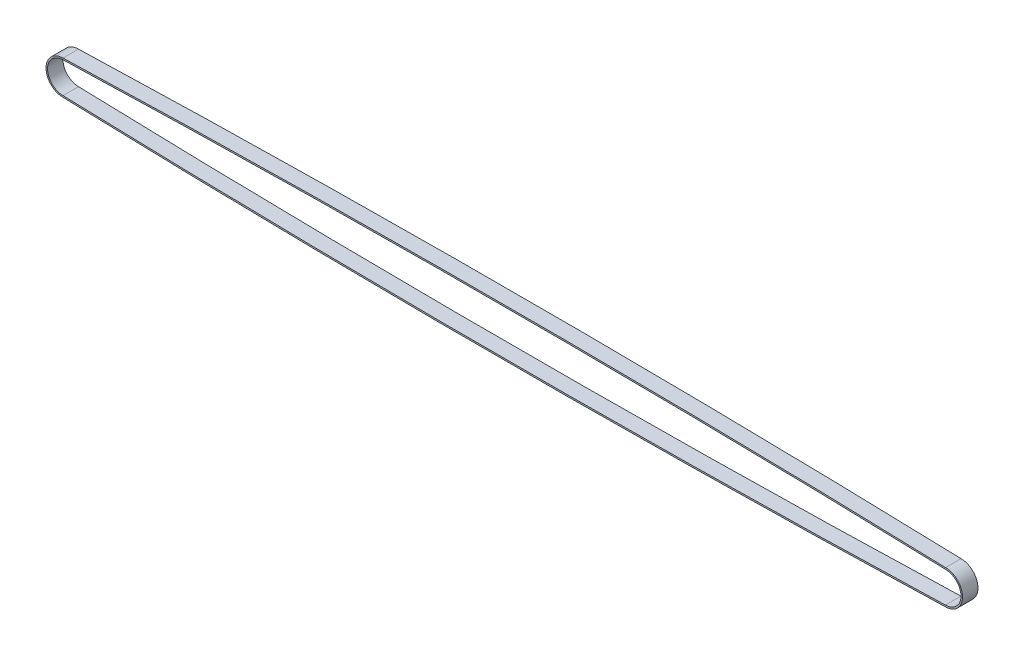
ISO-10303-21;
HEADER;
FILE_DESCRIPTION(('STEP AP214'),'2;1');
FILE_NAME('part.step','',(''),(''),'','','');
FILE_SCHEMA(('AUTOMOTIVE_DESIGN { 1 0 10303 214 1 1 1 1 }'));
ENDSEC;
DATA;
#1=APPLICATION_CONTEXT('core data for automotive mechanical design processes');
#2=APPLICATION_PROTOCOL_DEFINITION('international standard','automotive_design',2000,#1);
#3=PRODUCT_CONTEXT('',#1,'mechanical');
#4=PRODUCT('Part','Part','',(#3));
#5=PRODUCT_RELATED_PRODUCT_CATEGORY('part','',(#4));
#6=PRODUCT_DEFINITION_FORMATION('','',#4);
#7=PRODUCT_DEFINITION_CONTEXT('part definition',#1,'design');
#8=PRODUCT_DEFINITION('design','',#6,#7);
#9=PRODUCT_DEFINITION_SHAPE('','',#8);
#10=(LENGTH_UNIT() NAMED_UNIT(*) SI_UNIT(.MILLI.,.METRE.));
#11=(NAMED_UNIT(*) PLANE_ANGLE_UNIT() SI_UNIT($,.RADIAN.));
#12=(NAMED_UNIT(*) SI_UNIT($,.STERADIAN.) SOLID_ANGLE_UNIT());
#13=UNCERTAINTY_MEASURE_WITH_UNIT(LENGTH_MEASURE(1.E-05),#10,'distance_accuracy_value','');
#14=(GEOMETRIC_REPRESENTATION_CONTEXT(3) GLOBAL_UNCERTAINTY_ASSIGNED_CONTEXT((#13)) GLOBAL_UNIT_ASSIGNED_CONTEXT((#10,
#11,#12)) REPRESENTATION_CONTEXT('',''));
#15=CARTESIAN_POINT('',(0.,0.,0.));
#16=DIRECTION('',(0.,0.,1.));
#17=DIRECTION('',(1.,0.,0.));
#18=AXIS2_PLACEMENT_3D('',#15,#16,#17);
#19=CARTESIAN_POINT('',(361.95,-11436.9676875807,25.4));
#20=DIRECTION('',(0.,0.,-1.));
#21=DIRECTION('',(-1.,0.,0.));
#22=AXIS2_PLACEMENT_3D('',#19,#20,#21);
#23=PLANE('',#22);
#24=CARTESIAN_POINT('',(0.,-25.4000000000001,25.4));
#25=DIRECTION('',(0.,0.,1.));
#26=DIRECTION('',(-1.,0.,0.));
#27=AXIS2_PLACEMENT_3D('',#24,#25,#26);
#28=CIRCLE('',#27,27.9400000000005);
#29=CARTESIAN_POINT('',(-0.0411837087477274,2.53996964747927,25.4));
#30=VERTEX_POINT('',#29);
#31=CARTESIAN_POINT('',(-0.0411837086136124,-53.3399696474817,25.4));
#32=VERTEX_POINT('',#31);
#33=EDGE_CURVE('E134',#30,#32,#28,.T.);
#34=ORIENTED_EDGE('',*,*,#33,.T.);
#35=CARTESIAN_POINT('',(723.9,22797.7353751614,25.4));
#36=DIRECTION('',(0.,0.,1.));
#37=DIRECTION('',(1.,0.,0.));
#38=AXIS2_PLACEMENT_3D('',#35,#36,#37);
#39=CIRCLE('',#38,22862.54);
#40=CARTESIAN_POINT('',(1447.84118370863,-53.33996964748,25.4));
#41=VERTEX_POINT('',#40);
#42=EDGE_CURVE('E137',#32,#41,#39,.T.);
#43=ORIENTED_EDGE('',*,*,#42,.T.);
#44=CARTESIAN_POINT('',(1447.8,-25.4,25.4));
#45=DIRECTION('',(0.,0.,1.));
#46=DIRECTION('',(1.,0.,0.));
#47=AXIS2_PLACEMENT_3D('',#44,#45,#46);
#48=CIRCLE('',#47,27.9399999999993);
#49=CARTESIAN_POINT('',(1447.84118370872,2.53996964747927,25.4));
#50=VERTEX_POINT('',#49);
#51=EDGE_CURVE('E140',#41,#50,#48,.T.);
#52=ORIENTED_EDGE('',*,*,#51,.T.);
#53=CARTESIAN_POINT('',(723.9,-22848.5353751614,25.4));
#54=DIRECTION('',(0.,0.,1.));
#55=DIRECTION('',(-1.,0.,0.));
#56=AXIS2_PLACEMENT_3D('',#53,#54,#55);
#57=CIRCLE('',#56,22862.54);
#58=EDGE_CURVE('E142',#50,#30,#57,.T.);
#59=ORIENTED_EDGE('',*,*,#58,.T.);
#60=EDGE_LOOP('',(#34,#43,#52,#59));
#61=FACE_BOUND('',#60,.T.);
#62=CARTESIAN_POINT('',(723.9,-22848.5353751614,25.4));
#63=DIRECTION('',(0.,0.,1.));
#64=DIRECTION('',(-1.,0.,0.));
#65=AXIS2_PLACEMENT_3D('',#62,#63,#64);
#66=CIRCLE('',#65,22860.);
#67=CARTESIAN_POINT('',(1447.8,0.,25.4));
#68=VERTEX_POINT('',#67);
#69=CARTESIAN_POINT('',(0.,0.,25.4));
#70=VERTEX_POINT('',#69);
#71=EDGE_CURVE('E98',#68,#70,#66,.T.);
#72=ORIENTED_EDGE('',*,*,#71,.F.);
#73=CARTESIAN_POINT('',(1447.8,-25.4,25.4));
#74=DIRECTION('',(0.,0.,1.));
#75=DIRECTION('',(1.,0.,0.));
#76=AXIS2_PLACEMENT_3D('',#73,#74,#75);
#77=CIRCLE('',#76,25.4);
#78=CARTESIAN_POINT('',(1447.8,-50.8,25.4));
#79=VERTEX_POINT('',#78);
#80=EDGE_CURVE('E120',#79,#68,#77,.T.);
#81=ORIENTED_EDGE('',*,*,#80,.F.);
#82=CARTESIAN_POINT('',(723.9,22797.7353751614,25.4));
#83=DIRECTION('',(0.,0.,1.));
#84=DIRECTION('',(1.,0.,0.));
#85=AXIS2_PLACEMENT_3D('',#82,#83,#84);
#86=CIRCLE('',#85,22860.);
#87=CARTESIAN_POINT('',(0.,-50.8000000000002,25.4));
#88=VERTEX_POINT('',#87);
#89=EDGE_CURVE('E118',#88,#79,#86,.T.);
#90=ORIENTED_EDGE('',*,*,#89,.F.);
#91=CARTESIAN_POINT('',(0.,-25.4000000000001,25.4));
#92=DIRECTION('',(0.,0.,1.));
#93=DIRECTION('',(-1.,0.,0.));
#94=AXIS2_PLACEMENT_3D('',#91,#92,#93);
#95=CIRCLE('',#94,25.4000000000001);
#96=EDGE_CURVE('E106',#70,#88,#95,.T.);
#97=ORIENTED_EDGE('',*,*,#96,.F.);
#98=EDGE_LOOP('',(#72,#81,#90,#97));
#99=FACE_BOUND('',#98,.T.);
#100=ADVANCED_FACE('F33',(#61,#99),#23,.F.);
#101=CARTESIAN_POINT('',(361.95,-11436.9676875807,0.));
#102=DIRECTION('',(0.,0.,-1.));
#103=DIRECTION('',(-1.,0.,0.));
#104=AXIS2_PLACEMENT_3D('',#101,#102,#103);
#105=PLANE('',#104);
#106=CARTESIAN_POINT('',(0.,-25.4000000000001,0.));
#107=DIRECTION('',(0.,0.,1.));
#108=DIRECTION('',(-1.,0.,0.));
#109=AXIS2_PLACEMENT_3D('',#106,#107,#108);
#110=CIRCLE('',#109,27.9400000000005);
#111=CARTESIAN_POINT('',(-0.0411837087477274,2.53996964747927,0.));
#112=VERTEX_POINT('',#111);
#113=CARTESIAN_POINT('',(-0.0411837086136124,-53.3399696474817,0.));
#114=VERTEX_POINT('',#113);
#115=EDGE_CURVE('E114',#112,#114,#110,.T.);
#116=ORIENTED_EDGE('',*,*,#115,.F.);
#117=CARTESIAN_POINT('',(723.9,-22848.5353751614,0.));
#118=DIRECTION('',(0.,0.,1.));
#119=DIRECTION('',(-1.,0.,0.));
#120=AXIS2_PLACEMENT_3D('',#117,#118,#119);
#121=CIRCLE('',#120,22862.54);
#122=CARTESIAN_POINT('',(1447.84118370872,2.53996964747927,0.));
#123=VERTEX_POINT('',#122);
#124=EDGE_CURVE('E138',#123,#112,#121,.T.);
#125=ORIENTED_EDGE('',*,*,#124,.F.);
#126=CARTESIAN_POINT('',(1447.8,-25.4,0.));
#127=DIRECTION('',(0.,0.,1.));
#128=DIRECTION('',(1.,0.,0.));
#129=AXIS2_PLACEMENT_3D('',#126,#127,#128);
#130=CIRCLE('',#129,27.9399999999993);
#131=CARTESIAN_POINT('',(1447.84118370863,-53.33996964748,0.));
#132=VERTEX_POINT('',#131);
#133=EDGE_CURVE('E149',#132,#123,#130,.T.);
#134=ORIENTED_EDGE('',*,*,#133,.F.);
#135=CARTESIAN_POINT('',(723.9,22797.7353751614,0.));
#136=DIRECTION('',(0.,0.,1.));
#137=DIRECTION('',(1.,0.,0.));
#138=AXIS2_PLACEMENT_3D('',#135,#136,#137);
#139=CIRCLE('',#138,22862.54);
#140=EDGE_CURVE('E147',#114,#132,#139,.T.);
#141=ORIENTED_EDGE('',*,*,#140,.F.);
#142=EDGE_LOOP('',(#116,#125,#134,#141));
#143=FACE_BOUND('',#142,.T.);
#144=CARTESIAN_POINT('',(1447.8,-25.4,0.));
#145=DIRECTION('',(0.,0.,1.));
#146=DIRECTION('',(1.,0.,0.));
#147=AXIS2_PLACEMENT_3D('',#144,#145,#146);
#148=CIRCLE('',#147,25.4);
#149=CARTESIAN_POINT('',(1447.8,-50.7999999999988,0.));
#150=VERTEX_POINT('',#149);
#151=CARTESIAN_POINT('',(1447.8,0.,0.));
#152=VERTEX_POINT('',#151);
#153=EDGE_CURVE('E107',#150,#152,#148,.T.);
#154=ORIENTED_EDGE('',*,*,#153,.T.);
#155=CARTESIAN_POINT('',(723.9,-22848.5353751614,0.));
#156=DIRECTION('',(0.,0.,1.));
#157=DIRECTION('',(-1.,0.,0.));
#158=AXIS2_PLACEMENT_3D('',#155,#156,#157);
#159=CIRCLE('',#158,22860.);
#160=CARTESIAN_POINT('',(0.,0.,0.));
#161=VERTEX_POINT('',#160);
#162=EDGE_CURVE('E56',#152,#161,#159,.T.);
#163=ORIENTED_EDGE('',*,*,#162,.T.);
#164=CARTESIAN_POINT('',(0.,-25.4000000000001,0.));
#165=DIRECTION('',(0.,0.,1.));
#166=DIRECTION('',(-1.,0.,0.));
#167=AXIS2_PLACEMENT_3D('',#164,#165,#166);
#168=CIRCLE('',#167,25.4000000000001);
#169=CARTESIAN_POINT('',(0.,-50.8000000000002,0.));
#170=VERTEX_POINT('',#169);
#171=EDGE_CURVE('E113',#161,#170,#168,.T.);
#172=ORIENTED_EDGE('',*,*,#171,.T.);
#173=CARTESIAN_POINT('',(723.9,22797.7353751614,0.));
#174=DIRECTION('',(0.,0.,1.));
#175=DIRECTION('',(1.,0.,0.));
#176=AXIS2_PLACEMENT_3D('',#173,#174,#175);
#177=CIRCLE('',#176,22860.);
#178=EDGE_CURVE('E126',#170,#150,#177,.T.);
#179=ORIENTED_EDGE('',*,*,#178,.T.);
#180=EDGE_LOOP('',(#154,#163,#172,#179));
#181=FACE_BOUND('',#180,.T.);
#182=ADVANCED_FACE('F167',(#143,#181),#105,.T.);
#183=CARTESIAN_POINT('',(0.,-25.4000000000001,25.4));
#184=DIRECTION('',(0.,0.,-1.));
#185=DIRECTION('',(-1.,0.,0.));
#186=AXIS2_PLACEMENT_3D('',#183,#184,#185);
#187=CYLINDRICAL_SURFACE('',#186,27.9400000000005);
#188=ORIENTED_EDGE('',*,*,#115,.T.);
#189=DIRECTION('',(0.,0.,-1.));
#190=VECTOR('',#189,1.);
#191=CARTESIAN_POINT('',(-0.0411837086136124,-53.3399696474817,25.4));
#192=LINE('',#191,#190);
#193=EDGE_CURVE('E11',#32,#114,#192,.T.);
#194=ORIENTED_EDGE('',*,*,#193,.F.);
#195=ORIENTED_EDGE('',*,*,#33,.F.);
#196=DIRECTION('',(0.,0.,-1.));
#197=VECTOR('',#196,1.);
#198=CARTESIAN_POINT('',(-0.0411837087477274,2.53996964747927,25.4));
#199=LINE('',#198,#197);
#200=EDGE_CURVE('E144',#30,#112,#199,.T.);
#201=ORIENTED_EDGE('',*,*,#200,.T.);
#202=EDGE_LOOP('',(#188,#194,#195,#201));
#203=FACE_BOUND('',#202,.T.);
#204=ADVANCED_FACE('F35',(#203),#187,.T.);
#205=CARTESIAN_POINT('',(723.9,22797.7353751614,25.4));
#206=DIRECTION('',(0.,0.,-1.));
#207=DIRECTION('',(-1.,0.,0.));
#208=AXIS2_PLACEMENT_3D('',#205,#206,#207);
#209=CYLINDRICAL_SURFACE('',#208,22862.54);
#210=ORIENTED_EDGE('',*,*,#140,.T.);
#211=DIRECTION('',(0.,0.,-1.));
#212=VECTOR('',#211,1.);
#213=CARTESIAN_POINT('',(1447.84118370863,-53.33996964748,25.4));
#214=LINE('',#213,#212);
#215=EDGE_CURVE('E41',#41,#132,#214,.T.);
#216=ORIENTED_EDGE('',*,*,#215,.F.);
#217=ORIENTED_EDGE('',*,*,#42,.F.);
#218=ORIENTED_EDGE('',*,*,#193,.T.);
#219=EDGE_LOOP('',(#210,#216,#217,#218));
#220=FACE_BOUND('',#219,.T.);
#221=ADVANCED_FACE('F177',(#220),#209,.T.);
#222=CARTESIAN_POINT('',(1447.8,-25.4,25.4));
#223=DIRECTION('',(0.,0.,-1.));
#224=DIRECTION('',(-1.,0.,0.));
#225=AXIS2_PLACEMENT_3D('',#222,#223,#224);
#226=CYLINDRICAL_SURFACE('',#225,27.9399999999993);
#227=ORIENTED_EDGE('',*,*,#133,.T.);
#228=DIRECTION('',(0.,0.,-1.));
#229=VECTOR('',#228,1.);
#230=CARTESIAN_POINT('',(1447.84118370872,2.53996964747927,25.4));
#231=LINE('',#230,#229);
#232=EDGE_CURVE('E154',#50,#123,#231,.T.);
#233=ORIENTED_EDGE('',*,*,#232,.F.);
#234=ORIENTED_EDGE('',*,*,#51,.F.);
#235=ORIENTED_EDGE('',*,*,#215,.T.);
#236=EDGE_LOOP('',(#227,#233,#234,#235));
#237=FACE_BOUND('',#236,.T.);
#238=ADVANCED_FACE('F161',(#237),#226,.T.);
#239=CARTESIAN_POINT('',(723.9,-22848.5353751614,25.4));
#240=DIRECTION('',(0.,0.,-1.));
#241=DIRECTION('',(-1.,0.,0.));
#242=AXIS2_PLACEMENT_3D('',#239,#240,#241);
#243=CYLINDRICAL_SURFACE('',#242,22862.54);
#244=ORIENTED_EDGE('',*,*,#124,.T.);
#245=ORIENTED_EDGE('',*,*,#200,.F.);
#246=ORIENTED_EDGE('',*,*,#58,.F.);
#247=ORIENTED_EDGE('',*,*,#232,.T.);
#248=EDGE_LOOP('',(#244,#245,#246,#247));
#249=FACE_BOUND('',#248,.T.);
#250=ADVANCED_FACE('F171',(#249),#243,.T.);
#251=CARTESIAN_POINT('',(723.9,-22848.5353751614,25.4));
#252=DIRECTION('',(0.,0.,-1.));
#253=DIRECTION('',(-1.,0.,0.));
#254=AXIS2_PLACEMENT_3D('',#251,#252,#253);
#255=CYLINDRICAL_SURFACE('',#254,22860.);
#256=ORIENTED_EDGE('',*,*,#162,.F.);
#257=DIRECTION('',(0.,0.,-1.));
#258=VECTOR('',#257,1.);
#259=CARTESIAN_POINT('',(1447.8,0.,25.4));
#260=LINE('',#259,#258);
#261=EDGE_CURVE('E102',#68,#152,#260,.T.);
#262=ORIENTED_EDGE('',*,*,#261,.F.);
#263=ORIENTED_EDGE('',*,*,#71,.T.);
#264=DIRECTION('',(0.,0.,-1.));
#265=VECTOR('',#264,1.);
#266=CARTESIAN_POINT('',(0.,0.,25.4));
#267=LINE('',#266,#265);
#268=EDGE_CURVE('E101',#70,#161,#267,.T.);
#269=ORIENTED_EDGE('',*,*,#268,.T.);
#270=EDGE_LOOP('',(#256,#262,#263,#269));
#271=FACE_BOUND('',#270,.T.);
#272=ADVANCED_FACE('F100',(#271),#255,.F.);
#273=CARTESIAN_POINT('',(0.,-25.4000000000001,25.4));
#274=DIRECTION('',(0.,0.,-1.));
#275=DIRECTION('',(-1.,0.,0.));
#276=AXIS2_PLACEMENT_3D('',#273,#274,#275);
#277=CYLINDRICAL_SURFACE('',#276,25.4000000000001);
#278=ORIENTED_EDGE('',*,*,#171,.F.);
#279=ORIENTED_EDGE('',*,*,#268,.F.);
#280=ORIENTED_EDGE('',*,*,#96,.T.);
#281=DIRECTION('',(0.,0.,-1.));
#282=VECTOR('',#281,1.);
#283=CARTESIAN_POINT('',(0.,-50.8000000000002,25.4));
#284=LINE('',#283,#282);
#285=EDGE_CURVE('E115',#88,#170,#284,.T.);
#286=ORIENTED_EDGE('',*,*,#285,.T.);
#287=EDGE_LOOP('',(#278,#279,#280,#286));
#288=FACE_BOUND('',#287,.T.);
#289=ADVANCED_FACE('F110',(#288),#277,.F.);
#290=CARTESIAN_POINT('',(723.9,22797.7353751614,25.4));
#291=DIRECTION('',(0.,0.,-1.));
#292=DIRECTION('',(-1.,0.,0.));
#293=AXIS2_PLACEMENT_3D('',#290,#291,#292);
#294=CYLINDRICAL_SURFACE('',#293,22860.);
#295=ORIENTED_EDGE('',*,*,#178,.F.);
#296=ORIENTED_EDGE('',*,*,#285,.F.);
#297=ORIENTED_EDGE('',*,*,#89,.T.);
#298=DIRECTION('',(0.,0.,-1.));
#299=VECTOR('',#298,1.);
#300=CARTESIAN_POINT('',(1447.8,-50.7999999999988,25.4));
#301=LINE('',#300,#299);
#302=EDGE_CURVE('E48',#79,#150,#301,.T.);
#303=ORIENTED_EDGE('',*,*,#302,.T.);
#304=EDGE_LOOP('',(#295,#296,#297,#303));
#305=FACE_BOUND('',#304,.T.);
#306=ADVANCED_FACE('F200',(#305),#294,.F.);
#307=CARTESIAN_POINT('',(1447.8,-25.4,25.4));
#308=DIRECTION('',(0.,0.,-1.));
#309=DIRECTION('',(-1.,0.,0.));
#310=AXIS2_PLACEMENT_3D('',#307,#308,#309);
#311=CYLINDRICAL_SURFACE('',#310,25.4);
#312=ORIENTED_EDGE('',*,*,#153,.F.);
#313=ORIENTED_EDGE('',*,*,#302,.F.);
#314=ORIENTED_EDGE('',*,*,#80,.T.);
#315=ORIENTED_EDGE('',*,*,#261,.T.);
#316=EDGE_LOOP('',(#312,#313,#314,#315));
#317=FACE_BOUND('',#316,.T.);
#318=ADVANCED_FACE('F204',(#317),#311,.F.);
#319=CLOSED_SHELL('',(#100,#182,#204,#221,#238,#250,#272,#289,#306,#318));
#320=MANIFOLD_SOLID_BREP('B2',#319);
#321=ADVANCED_BREP_SHAPE_REPRESENTATION('',(#18,#320),#14);
#322=SHAPE_DEFINITION_REPRESENTATION(#9,#321);
ENDSEC;
END-ISO-10303-21;
